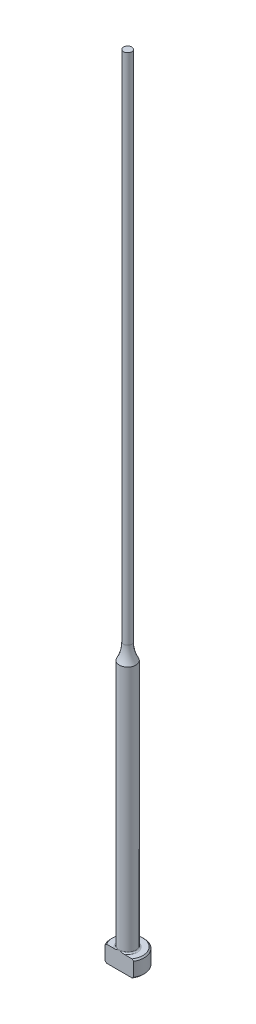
from build123d import *

# Parameters (mm, degrees)
CHAMFER1_SIZE      = 0.254
FILLET1_R          = 0.254
CUT_EXTRUDE1_DEPTH = 153.466131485


with BuildPart() as part:
    # Sketch1 → Revolve1 (revolve)
    with BuildSketch(Plane.XY, mode=Mode.PRIVATE) as revolve1_sk:
        with BuildLine():
            Line((0, 0), (-3.175, 0))
            Line((-3.175, 0), (-3.175, 3.175))
            Line((-3.175, 3.175), (-1.5875, 3.175))
            Line((-1.5875, 3.175), (-1.5875, 50.8))
            ThreePointArc((-1.5875, 50.8), (-0.995388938, 52.286680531), (-0.79375, 53.874180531))
            Line((-0.79375, 53.874180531), (-0.79375, 152.4))
            Line((-0.79375, 152.4), (0, 152.4))
            Line((0, 152.4), (0, 0))
        make_face()
    revolve(revolve1_sk.sketch.rotate(Axis((0, 259.958771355, 0), (0, -1, 0)), 270), axis=Axis((0, 259.958771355, 0), (0, -1, 0)))

    # Chamfer1
    chamfer1_edges = [part.edges().sort_by_distance(p)[0] for p in [
        (0, 0, -3.175),
        (0, 3.175, -3.175),
    ]]
    chamfer(chamfer1_edges, length=CHAMFER1_SIZE)

    # Fillet1
    fillet1_edges = [part.edges().sort_by_distance(p)[0] for p in [
        (0, 3.175, -1.5875),
    ]]
    fillet(fillet1_edges, radius=FILLET1_R)

    # Sketch2 → Cut-Extrude1 (cut, through all)
    with BuildSketch(Plane.XZ):
        with BuildLine():
            Line((-2.749630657, 1.5875), (2.749630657, 1.5875))
            ThreePointArc((2.749630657, 1.5875), (0, 3.175), (-2.749630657, 1.5875))
        make_face()
    extrude(amount=-CUT_EXTRUDE1_DEPTH, mode=Mode.SUBTRACT)


solid = part.part
